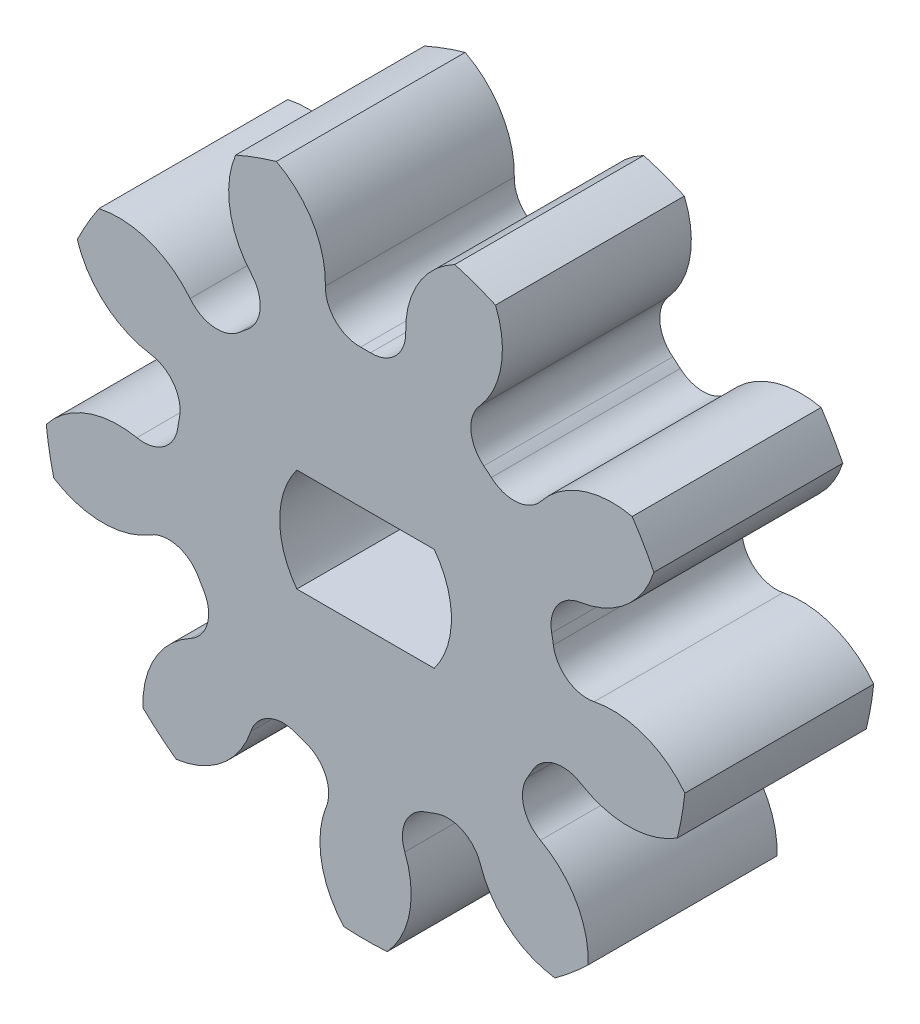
from build123d import *

# Parameters (mm, degrees)
BOSS_EXTRUDE1_DEPTH = 2.75
CUT_EXTRUDE1_DEPTH  = 5.5


with BuildPart() as part:
    # Sketch1 → Boss-Extrude1 (new, symmetric)
    with BuildSketch(Plane.XY):
        with BuildLine():
            ThreePointArc((9.077537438, -2.24071731), (9.207952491, -1.623610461), (9.296465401, -0.999115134))
            ThreePointArc((9.296465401, -0.999115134), (8.118568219, -0.127694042), (6.657846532, -0.013201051))
            ThreePointArc((6.657846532, -0.013201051), (5.884748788, 0.147298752), (5.469075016, 0.818607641))
            ThreePointArc((5.469075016, 0.818607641), (5.445986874, 0.960274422), (5.419229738, 1.101294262))
            ThreePointArc((5.419229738, 1.101294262), (5.580234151, 1.874287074), (6.251814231, 2.289522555))
            ThreePointArc((6.251814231, 2.289522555), (7.585284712, 2.896707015), (8.394102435, 4.118439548))
            ThreePointArc((8.394102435, 4.118439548), (8.097337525, 4.675), (7.76372449, 5.210286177))
            ThreePointArc((7.76372449, 5.210286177), (6.301264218, 5.120695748), (5.108691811, 4.269468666))
            ThreePointArc((5.108691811, 4.269468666), (4.413297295, 3.895480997), (3.663363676, 4.142543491))
            ThreePointArc((3.663363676, 4.142543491), (3.554615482, 4.23622577), (3.443472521, 4.327054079))
            ThreePointArc((3.443472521, 4.327054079), (3.069938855, 5.022692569), (3.31749082, 5.772464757))
            ThreePointArc((3.31749082, 5.772464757), (3.948697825, 7.094733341), (3.782973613, 8.55053277))
            ThreePointArc((3.782973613, 8.55053277), (3.19788834, 8.786126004), (2.598250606, 8.98173668))
            ThreePointArc((2.598250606, 8.98173668), (1.535528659, 7.973055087), (1.169123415, 6.554406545))
            ThreePointArc((1.169123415, 6.554406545), (0.87681495, 5.82092439), (0.143523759, 5.528137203))
            ThreePointArc((0.143523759, 5.528137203), (0, 5.53), (-0.143523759, 5.528137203))
            ThreePointArc((-0.143523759, 5.528137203), (-0.87681495, 5.82092439), (-1.169123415, 6.554406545))
            ThreePointArc((-1.169123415, 6.554406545), (-1.535528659, 7.973055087), (-2.598250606, 8.98173668))
            ThreePointArc((-2.598250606, 8.98173668), (-3.19788834, 8.786126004), (-3.782973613, 8.55053277))
            ThreePointArc((-3.782973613, 8.55053277), (-3.948697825, 7.094733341), (-3.31749082, 5.772464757))
            ThreePointArc((-3.31749082, 5.772464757), (-3.069938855, 5.022692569), (-3.443472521, 4.327054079))
            ThreePointArc((-3.443472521, 4.327054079), (-3.554615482, 4.23622577), (-3.663363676, 4.142543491))
            ThreePointArc((-3.663363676, 4.142543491), (-4.413297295, 3.895480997), (-5.108691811, 4.269468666))
            ThreePointArc((-5.108691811, 4.269468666), (-6.301264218, 5.120695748), (-7.76372449, 5.210286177))
            ThreePointArc((-7.76372449, 5.210286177), (-8.097337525, 4.675), (-8.394102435, 4.118439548))
            ThreePointArc((-8.394102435, 4.118439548), (-7.585284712, 2.896707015), (-6.251814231, 2.289522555))
            ThreePointArc((-6.251814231, 2.289522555), (-5.580234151, 1.874287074), (-5.419229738, 1.101294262))
            ThreePointArc((-5.419229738, 1.101294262), (-5.445986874, 0.960274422), (-5.469075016, 0.818607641))
            ThreePointArc((-5.469075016, 0.818607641), (-5.884748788, 0.147298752), (-6.657846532, -0.013201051))
            ThreePointArc((-6.657846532, -0.013201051), (-8.118568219, -0.127694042), (-9.296465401, -0.999115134))
            ThreePointArc((-9.296465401, -0.999115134), (-9.207952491, -1.623610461), (-9.077537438, -2.24071731))
            ThreePointArc((-9.077537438, -2.24071731), (-7.672632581, -2.656720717), (-6.260844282, -2.264712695))
            ThreePointArc((-6.260844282, -2.264712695), (-5.479475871, -2.151118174), (-4.859269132, -2.63977338))
            ThreePointArc((-4.859269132, -2.63977338), (-4.789120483, -2.765), (-4.715745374, -2.888363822))
            ThreePointArc((-4.715745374, -2.888363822), (-4.602660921, -3.669806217), (-5.091720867, -4.28969385))
            ThreePointArc((-5.091720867, -4.28969385), (-6.137103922, -5.316334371), (-6.479286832, -6.74101937))
            ThreePointArc((-6.479286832, -6.74101937), (-6.010064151, -7.162515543), (-5.513491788, -7.551417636))
            ThreePointArc((-5.513491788, -7.551417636), (-4.169870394, -6.967039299), (-3.340355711, -5.759263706))
            ThreePointArc((-3.340355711, -5.759263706), (-2.814809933, -5.169991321), (-2.025602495, -5.145661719))
            ThreePointArc((-2.025602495, -5.145661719), (-1.891371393, -5.196500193), (-1.755866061, -5.243837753))
            ThreePointArc((-1.755866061, -5.243837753), (-1.166936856, -5.769768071), (-1.14312242, -6.558991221))
            ThreePointArc((-1.14312242, -6.558991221), (-1.284020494, -8.017402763), (-0.630377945, -9.328725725))
            ThreePointArc((-0.630377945, -9.328725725), (0, -9.35), (0.630377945, -9.328725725))
            ThreePointArc((0.630377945, -9.328725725), (1.284020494, -8.017402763), (1.14312242, -6.558991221))
            ThreePointArc((1.14312242, -6.558991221), (1.166936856, -5.769768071), (1.755866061, -5.243837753))
            ThreePointArc((1.755866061, -5.243837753), (1.891371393, -5.196500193), (2.025602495, -5.145661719))
            ThreePointArc((2.025602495, -5.145661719), (2.814809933, -5.169991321), (3.340355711, -5.759263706))
            ThreePointArc((3.340355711, -5.759263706), (4.169870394, -6.967039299), (5.513491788, -7.551417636))
            ThreePointArc((5.513491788, -7.551417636), (6.010064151, -7.162515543), (6.479286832, -6.74101937))
            ThreePointArc((6.479286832, -6.74101937), (6.137103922, -5.316334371), (5.091720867, -4.28969385))
            ThreePointArc((5.091720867, -4.28969385), (4.602660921, -3.669806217), (4.715745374, -2.888363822))
            ThreePointArc((4.715745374, -2.888363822), (4.789120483, -2.765), (4.859269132, -2.63977338))
            ThreePointArc((4.859269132, -2.63977338), (5.479475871, -2.151118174), (6.260844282, -2.264712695))
            ThreePointArc((6.260844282, -2.264712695), (7.672632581, -2.656720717), (9.077537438, -2.24071731))
        make_face()
    extrude(amount=BOSS_EXTRUDE1_DEPTH, both=True)

    # Sketch2 → Cut-Extrude1 (cut)
    with BuildSketch(Plane.XY.offset(2.75)):
        with BuildLine():
            Line((2, 1.5), (-2, 1.5))
            ThreePointArc((-2, 1.5), (-2.5, 0), (-2, -1.5))
            Line((-2, -1.5), (2, -1.5))
            ThreePointArc((2, -1.5), (2.371708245, -0.790569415), (2.5, 0))
            ThreePointArc((2.5, 0), (2.371708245, 0.790569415), (2, 1.5))
        make_face()
    extrude(amount=-CUT_EXTRUDE1_DEPTH, mode=Mode.SUBTRACT)


solid = part.part
